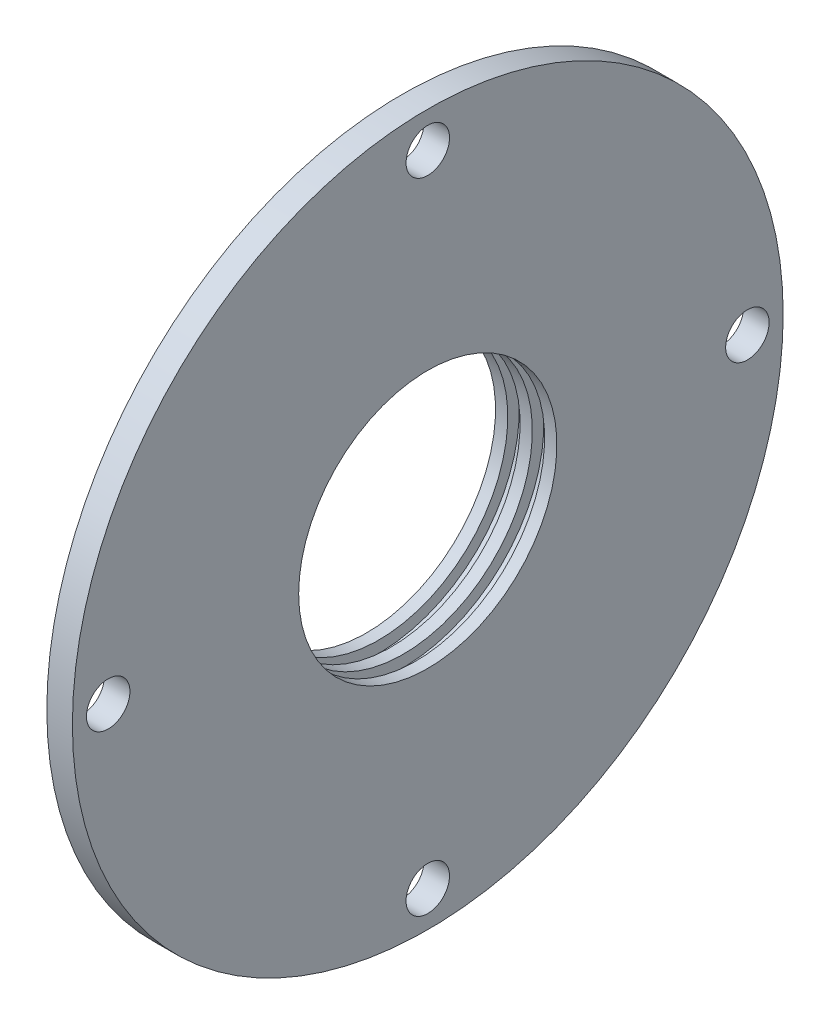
from build123d import *

# Parameters (mm, degrees)
ESQUISSE2_R                  = 4.25
ENL_V_MAT_EXTRU_1_DEPTH      = 100.01767519
R_P_TITION_CIRCULAIRE1_COUNT = 4
CHANFREIN1_SIZE              = 2
CHANFREIN1_SIZE2             = 1.154700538


with BuildPart() as part:
    # Esquisse1 → R_volution1 (revolve)
    with BuildSketch(Plane.XY, mode=Mode.PRIVATE) as r_volution1_sk:
        Polygon((-7, 35), (0, 35), (0, 69.5), (5, 69.5), (5, 25.25), (2.6, 25.25), (2.6, 27.5), (0.2, 27.5), (0.2, 25.25), (-2.2, 25.25), (-2.2, 27.5), (-4.6, 27.5), (-4.6, 25.25), (-7, 25.25), align=None)
    revolve(r_volution1_sk.sketch.rotate(Axis((-15.101172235, 0, 0), (1, 0, 0)), 90), axis=Axis((-15.101172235, 0, 0), (1, 0, 0)))

    # Esquisse2 → Enl_v. mat.-Extru.1 (cut, through all)
    with BuildSketch(Plane(origin=(5, 0, 0), x_dir=(0, 0, -1), z_dir=(1, 0, 0))):
        with Locations((0, 62.5)):
            Circle(ESQUISSE2_R)
    enl_v_mat_extru_1 = extrude(amount=-ENL_V_MAT_EXTRU_1_DEPTH, mode=Mode.SUBTRACT)

    # R_p_tition circulaire1: Enl_v. mat.-Extru.1 ×4 about axis
    r_p_tition_circulaire1_axis = Axis((0, 0, 0), (1, 0, 0))
    for i in range(1, R_P_TITION_CIRCULAIRE1_COUNT):
        add(enl_v_mat_extru_1.rotate(r_p_tition_circulaire1_axis, i * 360 / R_P_TITION_CIRCULAIRE1_COUNT), mode=Mode.SUBTRACT)

    # Chanfrein1
    chanfrein1_edges = [part.edges().sort_by_distance(p)[0] for p in [
        (-7, 0, -35),
    ]]
    chanfrein1_side = [part.faces().sort_by_distance(p)[0] for p in [
        (-3.5, 0, -35),
    ]]
    chamfer(chanfrein1_edges, length=CHANFREIN1_SIZE, length2=CHANFREIN1_SIZE2, reference=chanfrein1_side[0])


solid = part.part
